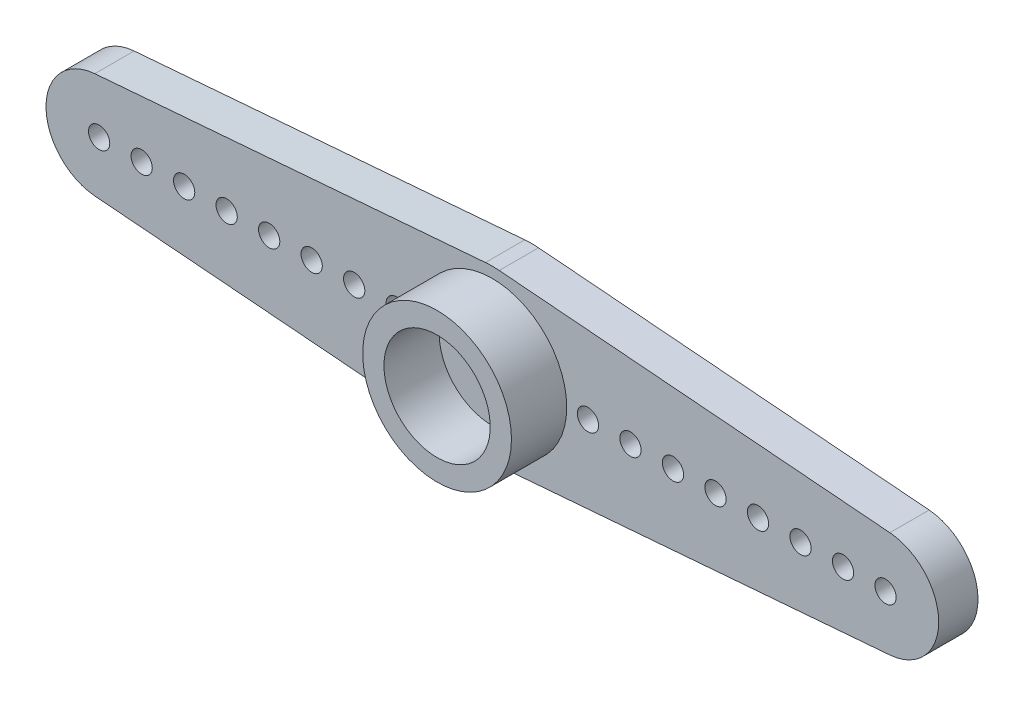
from build123d import *

# Parameters (mm, degrees)
BOSS_EXTRU_1_DEPTH            = 1.85
DIAM_TRE_DU_PER_AGE_1_0_1_1_D = 1
ESQUISSE5_R                   = 3.5
BOSS_EXTRU_2_DEPTH            = 2.6
ESQUISSE6_R                   = 2.75
BOSS_EXTRU_3_DEPTH            = 0.5


with BuildPart() as part:
    # Esquisse1 → Boss.-Extru.1 (new body)
    with BuildSketch(Plane.XY):
        with BuildLine():
            Line((0.324324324, 3.986830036), (18.702702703, 2.491768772))
            ThreePointArc((18.702702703, 2.491768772), (21, 0), (18.702702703, -2.491768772))
            Line((18.702702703, -2.491768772), (0.324324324, -3.986830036))
            ThreePointArc((0.324324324, -3.986830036), (0, -4), (-0.324324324, -3.986830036))
            Line((-0.324324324, -3.986830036), (-18.702702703, -2.491768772))
            ThreePointArc((-18.702702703, -2.491768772), (-21, 0), (-18.702702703, 2.491768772))
            Line((-18.702702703, 2.491768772), (-0.324324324, 3.986830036))
            ThreePointArc((-0.324324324, 3.986830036), (0, 4), (0.324324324, 3.986830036))
        make_face()
    extrude(amount=BOSS_EXTRU_1_DEPTH)

    # Diam_tre du per_age _1.0 _1_1 (through all)
    with Locations(Plane.XY.offset(1.85)):
        with Locations((-18.5, 0), (-16.5, 0), (-14.5, 0), (-12.5, 0), (-10.5, 0), (-8.5, 0), (-6.5, 0), (-4.5, 0), (4.5, 0), (6.5, 0), (8.5, 0), (10.5, 0), (12.5, 0), (14.5, 0), (16.5, 0), (18.5, 0)):
            Hole(DIAM_TRE_DU_PER_AGE_1_0_1_1_D / 2)

    # Esquisse5 → Boss.-Extru.2 (add)
    with BuildSketch(Plane.XY.offset(1.85)):
        Circle(ESQUISSE5_R)
    extrude(amount=BOSS_EXTRU_2_DEPTH)

    # Esquisse6 → Boss.-Extru.3 (add)
    with BuildSketch(Plane(origin=(0, 0, 0), x_dir=(-1, 0, 0), z_dir=(0, 0, -1))):
        with Locations(Location((0, 0, 0), (0, 0, 180))):
            Circle(ESQUISSE6_R)
    extrude(amount=BOSS_EXTRU_3_DEPTH)

    # Esquisse7 → Enl_vement de mati_re-R_volution1 (revolve, cut)
    with BuildSketch(Plane(origin=(0, 0, 0), x_dir=(1, 0, 0), z_dir=(0, 1, 0))):
        Polygon((-2.2, 0.5), (-2.2, -0.7), (-1.1, -0.7), (-1.1, -1.85), (-2.5, -1.85), (-2.5, -4.45), (0, -4.45), (0, 0.5), align=None)
    revolve(axis=Axis((0, 0, 0), (0, 0, 1)), mode=Mode.SUBTRACT)


solid = part.part
